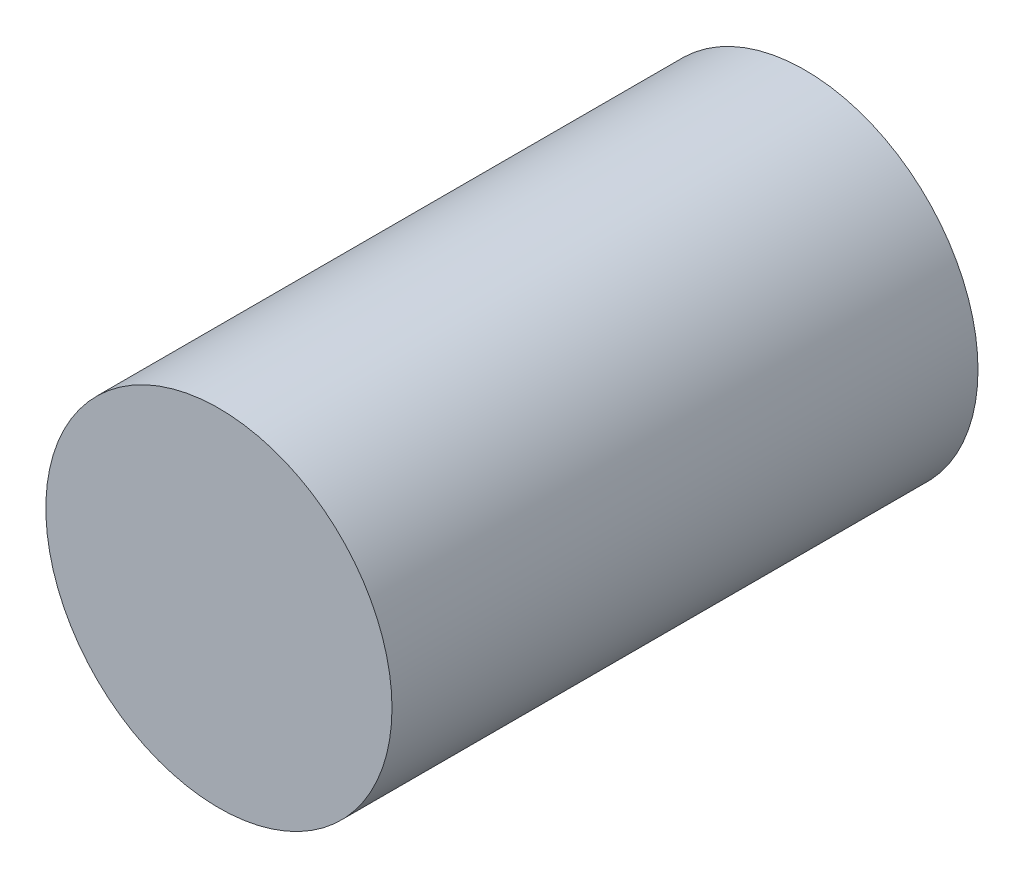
ISO-10303-21;
HEADER;
FILE_DESCRIPTION(('STEP AP214'),'2;1');
FILE_NAME('part.step','',(''),(''),'','','');
FILE_SCHEMA(('AUTOMOTIVE_DESIGN { 1 0 10303 214 1 1 1 1 }'));
ENDSEC;
DATA;
#1=APPLICATION_CONTEXT('core data for automotive mechanical design processes');
#2=APPLICATION_PROTOCOL_DEFINITION('international standard','automotive_design',2000,#1);
#3=PRODUCT_CONTEXT('',#1,'mechanical');
#4=PRODUCT('Part','Part','',(#3));
#5=PRODUCT_RELATED_PRODUCT_CATEGORY('part','',(#4));
#6=PRODUCT_DEFINITION_FORMATION('','',#4);
#7=PRODUCT_DEFINITION_CONTEXT('part definition',#1,'design');
#8=PRODUCT_DEFINITION('design','',#6,#7);
#9=PRODUCT_DEFINITION_SHAPE('','',#8);
#10=(LENGTH_UNIT() NAMED_UNIT(*) SI_UNIT(.MILLI.,.METRE.));
#11=(NAMED_UNIT(*) PLANE_ANGLE_UNIT() SI_UNIT($,.RADIAN.));
#12=(NAMED_UNIT(*) SI_UNIT($,.STERADIAN.) SOLID_ANGLE_UNIT());
#13=UNCERTAINTY_MEASURE_WITH_UNIT(LENGTH_MEASURE(1.E-05),#10,'distance_accuracy_value','');
#14=(GEOMETRIC_REPRESENTATION_CONTEXT(3) GLOBAL_UNCERTAINTY_ASSIGNED_CONTEXT((#13)) GLOBAL_UNIT_ASSIGNED_CONTEXT((#10,
#11,#12)) REPRESENTATION_CONTEXT('',''));
#15=CARTESIAN_POINT('',(0.,0.,0.));
#16=DIRECTION('',(0.,0.,1.));
#17=DIRECTION('',(1.,0.,0.));
#18=AXIS2_PLACEMENT_3D('',#15,#16,#17);
#19=CARTESIAN_POINT('',(38.3061852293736,34.2169341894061,-0.00999999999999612));
#20=DIRECTION('',(0.,0.,1.));
#21=DIRECTION('',(1.,0.,0.));
#22=AXIS2_PLACEMENT_3D('',#19,#20,#21);
#23=CYLINDRICAL_SURFACE('',#22,19.2044359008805);
#24=CARTESIAN_POINT('',(38.3061852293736,34.2169341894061,0.));
#25=DIRECTION('',(0.,0.,1.));
#26=DIRECTION('',(1.,0.,0.));
#27=AXIS2_PLACEMENT_3D('',#24,#25,#26);
#28=CIRCLE('',#27,19.2044359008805);
#29=CARTESIAN_POINT('',(57.5106211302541,34.2169341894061,0.));
#30=VERTEX_POINT('',#29);
#31=EDGE_CURVE('E28',#30,#30,#28,.T.);
#32=ORIENTED_EDGE('',*,*,#31,.T.);
#33=EDGE_LOOP('',(#32));
#34=FACE_BOUND('',#33,.T.);
#35=CARTESIAN_POINT('',(38.3061852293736,34.2169341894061,65.024));
#36=DIRECTION('',(0.,0.,1.));
#37=DIRECTION('',(1.,0.,0.));
#38=AXIS2_PLACEMENT_3D('',#35,#36,#37);
#39=CIRCLE('',#38,19.2044359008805);
#40=CARTESIAN_POINT('',(57.5106211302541,34.2169341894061,65.024));
#41=VERTEX_POINT('',#40);
#42=EDGE_CURVE('E10',#41,#41,#39,.T.);
#43=ORIENTED_EDGE('',*,*,#42,.F.);
#44=EDGE_LOOP('',(#43));
#45=FACE_BOUND('',#44,.T.);
#46=ADVANCED_FACE('F24',(#34,#45),#23,.T.);
#47=CARTESIAN_POINT('',(-30.6603352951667,34.2169341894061,0.));
#48=DIRECTION('',(0.,0.,1.));
#49=DIRECTION('',(1.,0.,0.));
#50=AXIS2_PLACEMENT_3D('',#47,#48,#49);
#51=PLANE('',#50);
#52=ORIENTED_EDGE('',*,*,#31,.F.);
#53=EDGE_LOOP('',(#52));
#54=FACE_BOUND('',#53,.T.);
#55=ADVANCED_FACE('F39',(#54),#51,.F.);
#56=CARTESIAN_POINT('',(-30.6603352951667,34.2169341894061,65.024));
#57=DIRECTION('',(0.,0.,1.));
#58=DIRECTION('',(1.,0.,0.));
#59=AXIS2_PLACEMENT_3D('',#56,#57,#58);
#60=PLANE('',#59);
#61=ORIENTED_EDGE('',*,*,#42,.T.);
#62=EDGE_LOOP('',(#61));
#63=FACE_BOUND('',#62,.T.);
#64=ADVANCED_FACE('F26',(#63),#60,.T.);
#65=CLOSED_SHELL('',(#46,#55,#64));
#66=MANIFOLD_SOLID_BREP('B2',#65);
#67=ADVANCED_BREP_SHAPE_REPRESENTATION('',(#18,#66),#14);
#68=SHAPE_DEFINITION_REPRESENTATION(#9,#67);
ENDSEC;
END-ISO-10303-21;
